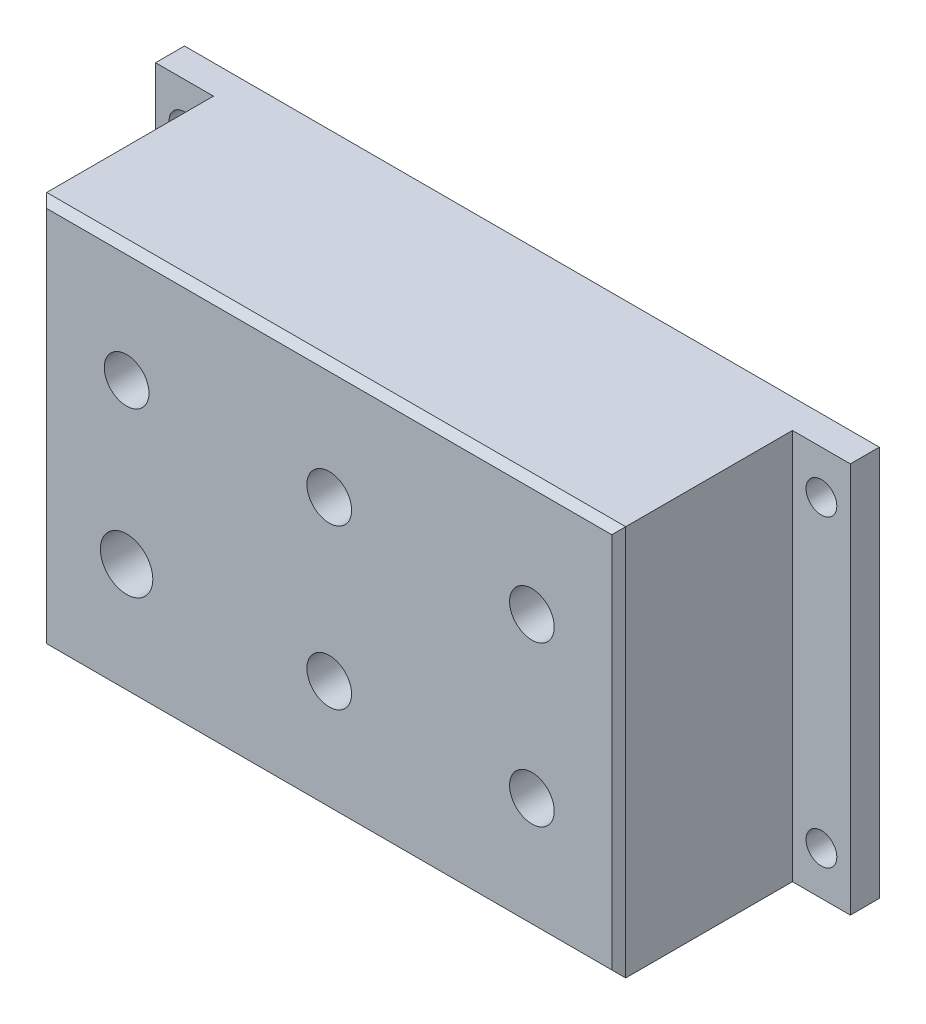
from build123d import *

# Parameters (mm, degrees)
SKETCH1_W          = 152.4
SKETCH1_H          = 85.725
BODY_DEPTH         = 44.45
SKETCH3_W          = 12.7
SKETCH3_H          = 85.725
EARS_DEPTH         = 38.1
SKETCH4_R          = 3.3782
MOUNT_HOLES_DEPTH  = 179.958502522
SKETCH5_R          = 5.7531
SKETCH5_R_2        = 4.9022
CONN_HOLES_DEPTH   = 181.417122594
CUT_EXTRUDE4_DEPTH = 28.575
CHAMFER1_SIZE      = 1.524


with BuildPart() as part:
    # Sketch1 → body (new body)
    with BuildSketch(Plane.XY):
        with Locations((76.2, 42.8625)):
            Rectangle(SKETCH1_W, SKETCH1_H)
    extrude(amount=BODY_DEPTH)

    # Sketch3 → ears (cut)
    with BuildSketch(Plane.XY.offset(44.45)):
        with Locations((6.35, 42.8625)):
            Rectangle(SKETCH3_W, SKETCH3_H)
        with Locations((146.05, 42.8625)):
            Rectangle(SKETCH3_W, SKETCH3_H)
    extrude(amount=-EARS_DEPTH, mode=Mode.SUBTRACT)

    # Sketch4 → mount holes (cut, through all)
    with BuildSketch(Plane.XY.offset(6.35)):
        with Locations((6.35, 76.2)):
            Circle(SKETCH4_R)
        with Locations((6.35, 9.525)):
            Circle(SKETCH4_R)
        with Locations((146.05, 9.525)):
            Circle(SKETCH4_R)
        with Locations((146.05, 76.2)):
            Circle(SKETCH4_R)
    extrude(amount=-MOUNT_HOLES_DEPTH, mode=Mode.SUBTRACT)

    # Sketch5 → conn holes (cut, through all)
    with BuildSketch(Plane.XY.offset(44.45)):
        with Locations((31.75, 25.4)):
            Circle(SKETCH5_R)
        with Locations((76.2, 25.4)):
            Circle(SKETCH5_R_2)
        with Locations((31.75, 60.325)):
            Circle(SKETCH5_R_2)
        with Locations((76.2, 60.325)):
            Circle(SKETCH5_R_2)
        with Locations((120.65, 60.325)):
            Circle(SKETCH5_R_2)
        with Locations((120.65, 25.4)):
            Circle(SKETCH5_R_2)
    extrude(amount=-CONN_HOLES_DEPTH, mode=Mode.SUBTRACT)

    # Sketch6 → Cut-Extrude4 (cut)
    with BuildSketch(Plane(origin=(0, 0, 0), x_dir=(-1, 0, 0), z_dir=(0, 0, -1))):
        with BuildLine():
            Line((-127, 79.375), (-25.4, 79.375))
            ThreePointArc((-25.4, 79.375), (-20.909871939, 77.515128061), (-19.05, 73.025))
            Line((-19.05, 73.025), (-19.05, 12.7))
            ThreePointArc((-19.05, 12.7), (-20.909871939, 8.209871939), (-25.4, 6.35))
            Line((-25.4, 6.35), (-127, 6.35))
            ThreePointArc((-127, 6.35), (-131.490128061, 8.209871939), (-133.35, 12.7))
            Line((-133.35, 12.7), (-133.35, 73.025))
            ThreePointArc((-133.35, 73.025), (-131.490128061, 77.515128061), (-127, 79.375))
        make_face()
    extrude(amount=-CUT_EXTRUDE4_DEPTH, mode=Mode.SUBTRACT)

    # Chamfer1
    chamfer1_edges = [part.edges().sort_by_distance(p)[0] for p in [
        (76.2, 0, 44.45),
        (12.7, 42.8625, 44.45),
        (76.2, 85.725, 44.45),
        (139.7, 42.8625, 44.45),
    ]]
    chamfer(chamfer1_edges, length=CHAMFER1_SIZE)

    # Sketch9 → 1_2 NPT Tapped Hole1 (revolve, cut)
    with BuildSketch(Plane(origin=(12.7, 42.8625, 21.844), x_dir=(0, 0, 1), z_dir=(0, 1, 0))):
        Polygon((0, 0), (0, 27.970543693), (8.9281, 22.606), (8.9281, 13.462), (9.479726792, 13.462), (9.8827971, 0), align=None)
    revolve(axis=Axis((6.35, 42.8625, 21.844), (1, 0, 0)), mode=Mode.SUBTRACT)


solid = part.part
